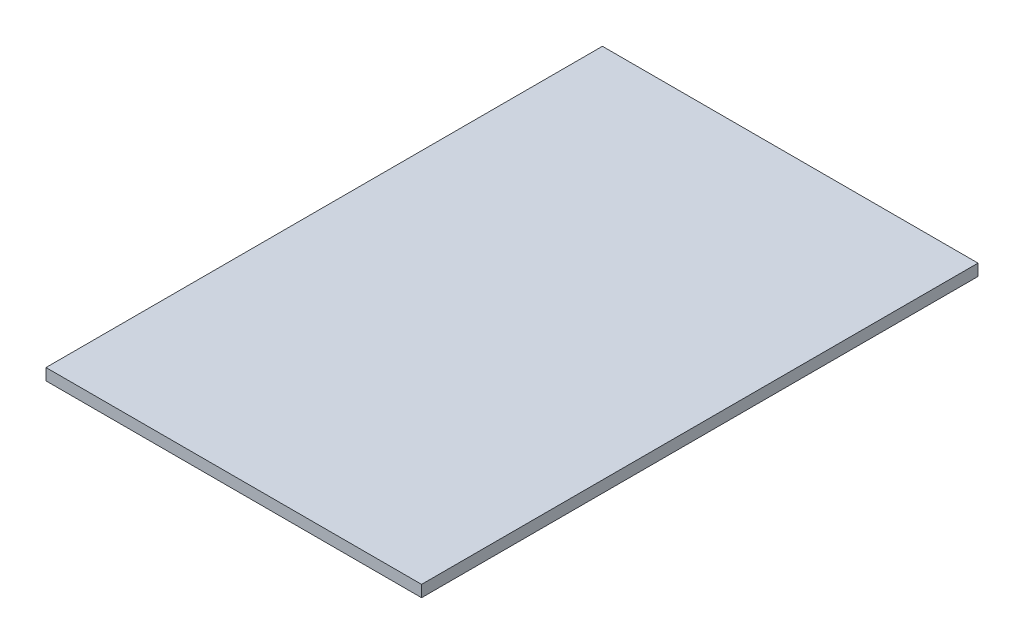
ISO-10303-21;
HEADER;
FILE_DESCRIPTION(('STEP AP214'),'2;1');
FILE_NAME('part.step','',(''),(''),'','','');
FILE_SCHEMA(('AUTOMOTIVE_DESIGN { 1 0 10303 214 1 1 1 1 }'));
ENDSEC;
DATA;
#1=APPLICATION_CONTEXT('core data for automotive mechanical design processes');
#2=APPLICATION_PROTOCOL_DEFINITION('international standard','automotive_design',2000,#1);
#3=PRODUCT_CONTEXT('',#1,'mechanical');
#4=PRODUCT('Part','Part','',(#3));
#5=PRODUCT_RELATED_PRODUCT_CATEGORY('part','',(#4));
#6=PRODUCT_DEFINITION_FORMATION('','',#4);
#7=PRODUCT_DEFINITION_CONTEXT('part definition',#1,'design');
#8=PRODUCT_DEFINITION('design','',#6,#7);
#9=PRODUCT_DEFINITION_SHAPE('','',#8);
#10=(LENGTH_UNIT() NAMED_UNIT(*) SI_UNIT(.MILLI.,.METRE.));
#11=(NAMED_UNIT(*) PLANE_ANGLE_UNIT() SI_UNIT($,.RADIAN.));
#12=(NAMED_UNIT(*) SI_UNIT($,.STERADIAN.) SOLID_ANGLE_UNIT());
#13=UNCERTAINTY_MEASURE_WITH_UNIT(LENGTH_MEASURE(1.E-05),#10,'distance_accuracy_value','');
#14=(GEOMETRIC_REPRESENTATION_CONTEXT(3) GLOBAL_UNCERTAINTY_ASSIGNED_CONTEXT((#13)) GLOBAL_UNIT_ASSIGNED_CONTEXT((#10,
#11,#12)) REPRESENTATION_CONTEXT('',''));
#15=CARTESIAN_POINT('',(0.,0.,0.));
#16=DIRECTION('',(0.,0.,1.));
#17=DIRECTION('',(1.,0.,0.));
#18=AXIS2_PLACEMENT_3D('',#15,#16,#17);
#19=CARTESIAN_POINT('',(14.4933099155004,2.5,-60.));
#20=DIRECTION('',(-1.,0.,0.));
#21=DIRECTION('',(0.,0.,1.));
#22=AXIS2_PLACEMENT_3D('',#19,#20,#21);
#23=PLANE('',#22);
#24=DIRECTION('',(0.,0.,-1.));
#25=VECTOR('',#24,1.);
#26=CARTESIAN_POINT('',(14.4933099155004,0.,-60.));
#27=LINE('',#26,#25);
#28=CARTESIAN_POINT('',(14.4933099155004,0.,60.00000003));
#29=VERTEX_POINT('',#28);
#30=CARTESIAN_POINT('',(14.4933099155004,0.,-60.));
#31=VERTEX_POINT('',#30);
#32=EDGE_CURVE('E95',#29,#31,#27,.T.);
#33=ORIENTED_EDGE('',*,*,#32,.T.);
#34=DIRECTION('',(0.,-1.,0.));
#35=VECTOR('',#34,1.);
#36=CARTESIAN_POINT('',(14.4933099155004,2.5,-60.));
#37=LINE('',#36,#35);
#38=CARTESIAN_POINT('',(14.4933099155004,2.5,-60.));
#39=VERTEX_POINT('',#38);
#40=EDGE_CURVE('E11',#39,#31,#37,.T.);
#41=ORIENTED_EDGE('',*,*,#40,.F.);
#42=DIRECTION('',(0.,0.,-1.));
#43=VECTOR('',#42,1.);
#44=CARTESIAN_POINT('',(14.4933099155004,2.5,-60.));
#45=LINE('',#44,#43);
#46=CARTESIAN_POINT('',(14.4933099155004,2.5,60.00000003));
#47=VERTEX_POINT('',#46);
#48=EDGE_CURVE('E83',#47,#39,#45,.T.);
#49=ORIENTED_EDGE('',*,*,#48,.F.);
#50=DIRECTION('',(0.,-1.,0.));
#51=VECTOR('',#50,1.);
#52=CARTESIAN_POINT('',(14.4933099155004,2.5,60.00000003));
#53=LINE('',#52,#51);
#54=EDGE_CURVE('E91',#47,#29,#53,.T.);
#55=ORIENTED_EDGE('',*,*,#54,.T.);
#56=EDGE_LOOP('',(#33,#41,#49,#55));
#57=FACE_BOUND('',#56,.T.);
#58=ADVANCED_FACE('F32',(#57),#23,.F.);
#59=CARTESIAN_POINT('',(-66.5066901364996,2.5,-60.));
#60=DIRECTION('',(0.,0.,1.));
#61=DIRECTION('',(1.,0.,0.));
#62=AXIS2_PLACEMENT_3D('',#59,#60,#61);
#63=PLANE('',#62);
#64=DIRECTION('',(-1.,0.,0.));
#65=VECTOR('',#64,1.);
#66=CARTESIAN_POINT('',(-66.5066901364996,0.,-60.));
#67=LINE('',#66,#65);
#68=CARTESIAN_POINT('',(-66.5066901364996,0.,-60.));
#69=VERTEX_POINT('',#68);
#70=EDGE_CURVE('E87',#31,#69,#67,.T.);
#71=ORIENTED_EDGE('',*,*,#70,.T.);
#72=DIRECTION('',(0.,-1.,0.));
#73=VECTOR('',#72,1.);
#74=CARTESIAN_POINT('',(-66.5066901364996,2.5,-60.));
#75=LINE('',#74,#73);
#76=CARTESIAN_POINT('',(-66.5066901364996,2.5,-60.));
#77=VERTEX_POINT('',#76);
#78=EDGE_CURVE('E40',#77,#69,#75,.T.);
#79=ORIENTED_EDGE('',*,*,#78,.F.);
#80=DIRECTION('',(-1.,0.,0.));
#81=VECTOR('',#80,1.);
#82=CARTESIAN_POINT('',(-66.5066901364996,2.5,-60.));
#83=LINE('',#82,#81);
#84=EDGE_CURVE('E78',#39,#77,#83,.T.);
#85=ORIENTED_EDGE('',*,*,#84,.F.);
#86=ORIENTED_EDGE('',*,*,#40,.T.);
#87=EDGE_LOOP('',(#71,#79,#85,#86));
#88=FACE_BOUND('',#87,.T.);
#89=ADVANCED_FACE('F86',(#88),#63,.F.);
#90=CARTESIAN_POINT('',(-66.5066901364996,2.5,-60.));
#91=DIRECTION('',(1.,0.,0.));
#92=DIRECTION('',(0.,0.,-1.));
#93=AXIS2_PLACEMENT_3D('',#90,#91,#92);
#94=PLANE('',#93);
#95=DIRECTION('',(0.,0.,1.));
#96=VECTOR('',#95,1.);
#97=CARTESIAN_POINT('',(-66.5066901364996,0.,-60.));
#98=LINE('',#97,#96);
#99=CARTESIAN_POINT('',(-66.5066901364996,0.,60.00000003));
#100=VERTEX_POINT('',#99);
#101=EDGE_CURVE('E65',#69,#100,#98,.T.);
#102=ORIENTED_EDGE('',*,*,#101,.T.);
#103=DIRECTION('',(0.,-1.,0.));
#104=VECTOR('',#103,1.);
#105=CARTESIAN_POINT('',(-66.5066901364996,2.5,60.00000003));
#106=LINE('',#105,#104);
#107=CARTESIAN_POINT('',(-66.5066901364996,2.5,60.00000003));
#108=VERTEX_POINT('',#107);
#109=EDGE_CURVE('E88',#108,#100,#106,.T.);
#110=ORIENTED_EDGE('',*,*,#109,.F.);
#111=DIRECTION('',(0.,0.,1.));
#112=VECTOR('',#111,1.);
#113=CARTESIAN_POINT('',(-66.5066901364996,2.5,-60.));
#114=LINE('',#113,#112);
#115=EDGE_CURVE('E81',#77,#108,#114,.T.);
#116=ORIENTED_EDGE('',*,*,#115,.F.);
#117=ORIENTED_EDGE('',*,*,#78,.T.);
#118=EDGE_LOOP('',(#102,#110,#116,#117));
#119=FACE_BOUND('',#118,.T.);
#120=ADVANCED_FACE('F89',(#119),#94,.F.);
#121=CARTESIAN_POINT('',(-66.5066901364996,2.5,60.00000003));
#122=DIRECTION('',(0.,0.,-1.));
#123=DIRECTION('',(-1.,0.,0.));
#124=AXIS2_PLACEMENT_3D('',#121,#122,#123);
#125=PLANE('',#124);
#126=DIRECTION('',(1.,0.,0.));
#127=VECTOR('',#126,1.);
#128=CARTESIAN_POINT('',(-66.5066901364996,0.,60.00000003));
#129=LINE('',#128,#127);
#130=EDGE_CURVE('E71',#100,#29,#129,.T.);
#131=ORIENTED_EDGE('',*,*,#130,.T.);
#132=ORIENTED_EDGE('',*,*,#54,.F.);
#133=DIRECTION('',(1.,0.,0.));
#134=VECTOR('',#133,1.);
#135=CARTESIAN_POINT('',(-66.5066901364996,2.5,60.00000003));
#136=LINE('',#135,#134);
#137=EDGE_CURVE('E48',#108,#47,#136,.T.);
#138=ORIENTED_EDGE('',*,*,#137,.F.);
#139=ORIENTED_EDGE('',*,*,#109,.T.);
#140=EDGE_LOOP('',(#131,#132,#138,#139));
#141=FACE_BOUND('',#140,.T.);
#142=ADVANCED_FACE('F102',(#141),#125,.F.);
#143=CARTESIAN_POINT('',(0.,2.5,0.));
#144=DIRECTION('',(0.,1.,0.));
#145=DIRECTION('',(0.,0.,1.));
#146=AXIS2_PLACEMENT_3D('',#143,#144,#145);
#147=PLANE('',#146);
#148=ORIENTED_EDGE('',*,*,#48,.T.);
#149=ORIENTED_EDGE('',*,*,#84,.T.);
#150=ORIENTED_EDGE('',*,*,#115,.T.);
#151=ORIENTED_EDGE('',*,*,#137,.T.);
#152=EDGE_LOOP('',(#148,#149,#150,#151));
#153=FACE_BOUND('',#152,.T.);
#154=ADVANCED_FACE('F79',(#153),#147,.T.);
#155=CARTESIAN_POINT('',(0.,0.,0.));
#156=DIRECTION('',(0.,1.,0.));
#157=DIRECTION('',(0.,0.,1.));
#158=AXIS2_PLACEMENT_3D('',#155,#156,#157);
#159=PLANE('',#158);
#160=ORIENTED_EDGE('',*,*,#32,.F.);
#161=ORIENTED_EDGE('',*,*,#130,.F.);
#162=ORIENTED_EDGE('',*,*,#101,.F.);
#163=ORIENTED_EDGE('',*,*,#70,.F.);
#164=EDGE_LOOP('',(#160,#161,#162,#163));
#165=FACE_BOUND('',#164,.T.);
#166=ADVANCED_FACE('F105',(#165),#159,.F.);
#167=CLOSED_SHELL('',(#58,#89,#120,#142,#154,#166));
#168=MANIFOLD_SOLID_BREP('B2',#167);
#169=ADVANCED_BREP_SHAPE_REPRESENTATION('',(#18,#168),#14);
#170=SHAPE_DEFINITION_REPRESENTATION(#9,#169);
ENDSEC;
END-ISO-10303-21;
